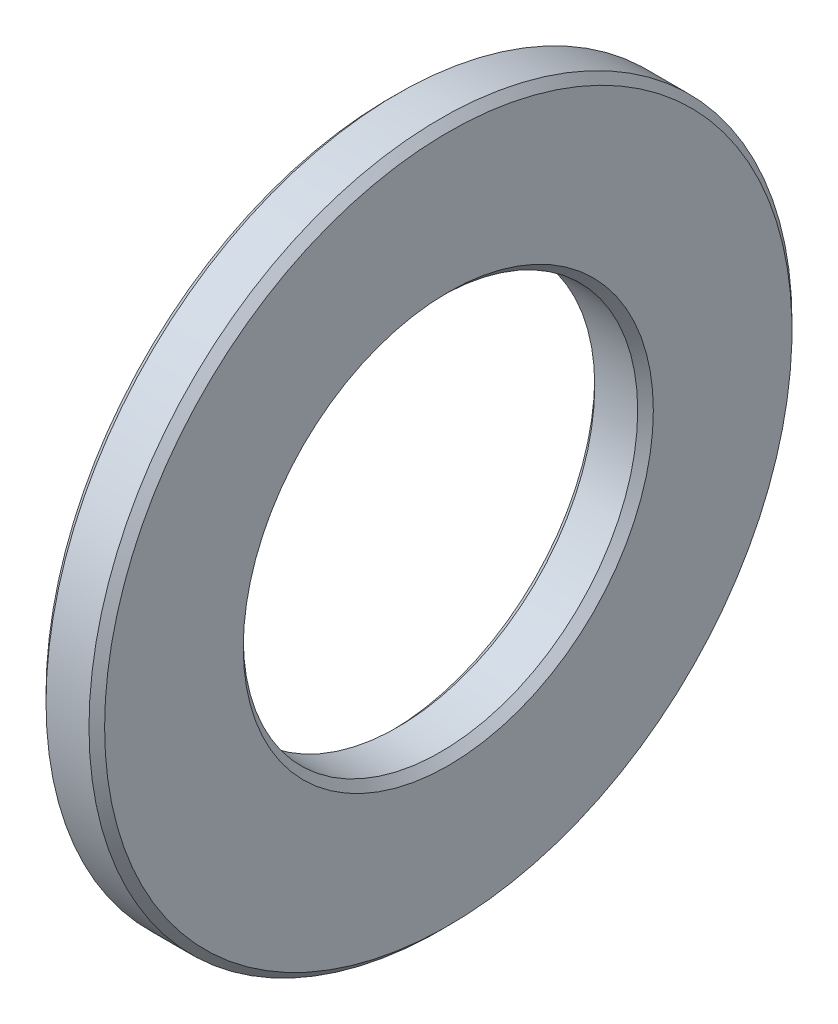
ISO-10303-21;
HEADER;
FILE_DESCRIPTION(('STEP AP214'),'2;1');
FILE_NAME('part.step','',(''),(''),'','','');
FILE_SCHEMA(('AUTOMOTIVE_DESIGN { 1 0 10303 214 1 1 1 1 }'));
ENDSEC;
DATA;
#1=APPLICATION_CONTEXT('core data for automotive mechanical design processes');
#2=APPLICATION_PROTOCOL_DEFINITION('international standard','automotive_design',2000,#1);
#3=PRODUCT_CONTEXT('',#1,'mechanical');
#4=PRODUCT('Part','Part','',(#3));
#5=PRODUCT_RELATED_PRODUCT_CATEGORY('part','',(#4));
#6=PRODUCT_DEFINITION_FORMATION('','',#4);
#7=PRODUCT_DEFINITION_CONTEXT('part definition',#1,'design');
#8=PRODUCT_DEFINITION('design','',#6,#7);
#9=PRODUCT_DEFINITION_SHAPE('','',#8);
#10=(LENGTH_UNIT() NAMED_UNIT(*) SI_UNIT(.MILLI.,.METRE.));
#11=(NAMED_UNIT(*) PLANE_ANGLE_UNIT() SI_UNIT($,.RADIAN.));
#12=(NAMED_UNIT(*) SI_UNIT($,.STERADIAN.) SOLID_ANGLE_UNIT());
#13=UNCERTAINTY_MEASURE_WITH_UNIT(LENGTH_MEASURE(1.E-05),#10,'distance_accuracy_value','');
#14=(GEOMETRIC_REPRESENTATION_CONTEXT(3) GLOBAL_UNCERTAINTY_ASSIGNED_CONTEXT((#13)) GLOBAL_UNIT_ASSIGNED_CONTEXT((#10,
#11,#12)) REPRESENTATION_CONTEXT('',''));
#15=CARTESIAN_POINT('',(0.,0.,0.));
#16=DIRECTION('',(0.,0.,1.));
#17=DIRECTION('',(1.,0.,0.));
#18=AXIS2_PLACEMENT_3D('',#15,#16,#17);
#19=CARTESIAN_POINT('',(0.,5.25,0.));
#20=DIRECTION('',(1.,0.,0.));
#21=DIRECTION('',(0.,0.,-1.));
#22=AXIS2_PLACEMENT_3D('',#19,#20,#21);
#23=PLANE('',#22);
#24=CARTESIAN_POINT('',(0.,0.,0.));
#25=DIRECTION('',(-1.,0.,0.));
#26=DIRECTION('',(0.,0.,1.));
#27=AXIS2_PLACEMENT_3D('',#24,#25,#26);
#28=CIRCLE('',#27,5.25);
#29=CARTESIAN_POINT('',(0.,0.,5.25));
#30=VERTEX_POINT('',#29);
#31=EDGE_CURVE('E63',#30,#30,#28,.T.);
#32=ORIENTED_EDGE('',*,*,#31,.F.);
#33=EDGE_LOOP('',(#32));
#34=FACE_BOUND('',#33,.T.);
#35=CARTESIAN_POINT('',(0.,0.,0.));
#36=DIRECTION('',(-1.,0.,0.));
#37=DIRECTION('',(0.,0.,1.));
#38=AXIS2_PLACEMENT_3D('',#35,#36,#37);
#39=CIRCLE('',#38,8.8);
#40=CARTESIAN_POINT('',(0.,0.,8.8));
#41=VERTEX_POINT('',#40);
#42=EDGE_CURVE('E10',#41,#41,#39,.T.);
#43=ORIENTED_EDGE('',*,*,#42,.T.);
#44=EDGE_LOOP('',(#43));
#45=FACE_BOUND('',#44,.T.);
#46=ADVANCED_FACE('F35',(#34,#45),#23,.F.);
#47=CARTESIAN_POINT('',(0.2,0.,0.));
#48=DIRECTION('',(1.,0.,0.));
#49=DIRECTION('',(0.,0.,-1.));
#50=AXIS2_PLACEMENT_3D('',#47,#48,#49);
#51=CONICAL_SURFACE('',#50,9.,0.78539816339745);
#52=ORIENTED_EDGE('',*,*,#42,.F.);
#53=EDGE_LOOP('',(#52));
#54=FACE_BOUND('',#53,.T.);
#55=CARTESIAN_POINT('',(0.2,0.,0.));
#56=DIRECTION('',(-1.,0.,0.));
#57=DIRECTION('',(0.,0.,1.));
#58=AXIS2_PLACEMENT_3D('',#55,#56,#57);
#59=CIRCLE('',#58,9.);
#60=CARTESIAN_POINT('',(0.2,0.,9.));
#61=VERTEX_POINT('',#60);
#62=EDGE_CURVE('E41',#61,#61,#59,.T.);
#63=ORIENTED_EDGE('',*,*,#62,.T.);
#64=EDGE_LOOP('',(#63));
#65=FACE_BOUND('',#64,.T.);
#66=ADVANCED_FACE('F70',(#54,#65),#51,.T.);
#67=CARTESIAN_POINT('',(0.,0.,0.));
#68=DIRECTION('',(-1.,0.,0.));
#69=DIRECTION('',(0.,0.,1.));
#70=AXIS2_PLACEMENT_3D('',#67,#68,#69);
#71=CYLINDRICAL_SURFACE('',#70,9.);
#72=ORIENTED_EDGE('',*,*,#62,.F.);
#73=EDGE_LOOP('',(#72));
#74=FACE_BOUND('',#73,.T.);
#75=CARTESIAN_POINT('',(1.3,0.,0.));
#76=DIRECTION('',(-1.,0.,0.));
#77=DIRECTION('',(0.,0.,1.));
#78=AXIS2_PLACEMENT_3D('',#75,#76,#77);
#79=CIRCLE('',#78,9.);
#80=CARTESIAN_POINT('',(1.3,0.,9.));
#81=VERTEX_POINT('',#80);
#82=EDGE_CURVE('E45',#81,#81,#79,.T.);
#83=ORIENTED_EDGE('',*,*,#82,.T.);
#84=EDGE_LOOP('',(#83));
#85=FACE_BOUND('',#84,.T.);
#86=ADVANCED_FACE('F74',(#74,#85),#71,.T.);
#87=CARTESIAN_POINT('',(1.5,0.,0.));
#88=DIRECTION('',(-1.,0.,0.));
#89=DIRECTION('',(0.,0.,1.));
#90=AXIS2_PLACEMENT_3D('',#87,#88,#89);
#91=CONICAL_SURFACE('',#90,8.8,0.785398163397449);
#92=ORIENTED_EDGE('',*,*,#82,.F.);
#93=EDGE_LOOP('',(#92));
#94=FACE_BOUND('',#93,.T.);
#95=CARTESIAN_POINT('',(1.5,0.,0.));
#96=DIRECTION('',(-1.,0.,0.));
#97=DIRECTION('',(0.,0.,1.));
#98=AXIS2_PLACEMENT_3D('',#95,#96,#97);
#99=CIRCLE('',#98,8.8);
#100=CARTESIAN_POINT('',(1.5,0.,8.8));
#101=VERTEX_POINT('',#100);
#102=EDGE_CURVE('E49',#101,#101,#99,.T.);
#103=ORIENTED_EDGE('',*,*,#102,.T.);
#104=EDGE_LOOP('',(#103));
#105=FACE_BOUND('',#104,.T.);
#106=ADVANCED_FACE('F79',(#94,#105),#91,.T.);
#107=CARTESIAN_POINT('',(1.5,5.25,0.));
#108=DIRECTION('',(-1.,0.,0.));
#109=DIRECTION('',(0.,0.,1.));
#110=AXIS2_PLACEMENT_3D('',#107,#108,#109);
#111=PLANE('',#110);
#112=ORIENTED_EDGE('',*,*,#102,.F.);
#113=EDGE_LOOP('',(#112));
#114=FACE_BOUND('',#113,.T.);
#115=CARTESIAN_POINT('',(1.5,0.,0.));
#116=DIRECTION('',(-1.,0.,0.));
#117=DIRECTION('',(0.,0.,1.));
#118=AXIS2_PLACEMENT_3D('',#115,#116,#117);
#119=CIRCLE('',#118,5.25);
#120=CARTESIAN_POINT('',(1.5,0.,5.25));
#121=VERTEX_POINT('',#120);
#122=EDGE_CURVE('E54',#121,#121,#119,.T.);
#123=ORIENTED_EDGE('',*,*,#122,.T.);
#124=EDGE_LOOP('',(#123));
#125=FACE_BOUND('',#124,.T.);
#126=ADVANCED_FACE('F85',(#114,#125),#111,.F.);
#127=CARTESIAN_POINT('',(1.3,0.,0.));
#128=DIRECTION('',(1.,0.,0.));
#129=DIRECTION('',(0.,0.,-1.));
#130=AXIS2_PLACEMENT_3D('',#127,#128,#129);
#131=CONICAL_SURFACE('',#130,5.05,0.785398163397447);
#132=ORIENTED_EDGE('',*,*,#122,.F.);
#133=EDGE_LOOP('',(#132));
#134=FACE_BOUND('',#133,.T.);
#135=CARTESIAN_POINT('',(1.3,0.,0.));
#136=DIRECTION('',(-1.,0.,0.));
#137=DIRECTION('',(0.,0.,1.));
#138=AXIS2_PLACEMENT_3D('',#135,#136,#137);
#139=CIRCLE('',#138,5.05);
#140=CARTESIAN_POINT('',(1.3,0.,5.05));
#141=VERTEX_POINT('',#140);
#142=EDGE_CURVE('E57',#141,#141,#139,.T.);
#143=ORIENTED_EDGE('',*,*,#142,.T.);
#144=EDGE_LOOP('',(#143));
#145=FACE_BOUND('',#144,.T.);
#146=ADVANCED_FACE('F89',(#134,#145),#131,.F.);
#147=CARTESIAN_POINT('',(0.,0.,0.));
#148=DIRECTION('',(-1.,0.,0.));
#149=DIRECTION('',(0.,0.,1.));
#150=AXIS2_PLACEMENT_3D('',#147,#148,#149);
#151=CYLINDRICAL_SURFACE('',#150,5.05);
#152=ORIENTED_EDGE('',*,*,#142,.F.);
#153=EDGE_LOOP('',(#152));
#154=FACE_BOUND('',#153,.T.);
#155=CARTESIAN_POINT('',(0.2,0.,0.));
#156=DIRECTION('',(-1.,0.,0.));
#157=DIRECTION('',(0.,0.,1.));
#158=AXIS2_PLACEMENT_3D('',#155,#156,#157);
#159=CIRCLE('',#158,5.05);
#160=CARTESIAN_POINT('',(0.2,0.,5.05));
#161=VERTEX_POINT('',#160);
#162=EDGE_CURVE('E60',#161,#161,#159,.T.);
#163=ORIENTED_EDGE('',*,*,#162,.T.);
#164=EDGE_LOOP('',(#163));
#165=FACE_BOUND('',#164,.T.);
#166=ADVANCED_FACE('F93',(#154,#165),#151,.F.);
#167=CARTESIAN_POINT('',(0.,0.,0.));
#168=DIRECTION('',(-1.,0.,0.));
#169=DIRECTION('',(0.,0.,1.));
#170=AXIS2_PLACEMENT_3D('',#167,#168,#169);
#171=CONICAL_SURFACE('',#170,5.25,0.785398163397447);
#172=ORIENTED_EDGE('',*,*,#162,.F.);
#173=EDGE_LOOP('',(#172));
#174=FACE_BOUND('',#173,.T.);
#175=ORIENTED_EDGE('',*,*,#31,.T.);
#176=EDGE_LOOP('',(#175));
#177=FACE_BOUND('',#176,.T.);
#178=ADVANCED_FACE('F67',(#174,#177),#171,.F.);
#179=CLOSED_SHELL('',(#46,#66,#86,#106,#126,#146,#166,#178));
#180=MANIFOLD_SOLID_BREP('B2',#179);
#181=ADVANCED_BREP_SHAPE_REPRESENTATION('',(#18,#180),#14);
#182=SHAPE_DEFINITION_REPRESENTATION(#9,#181);
ENDSEC;
END-ISO-10303-21;
